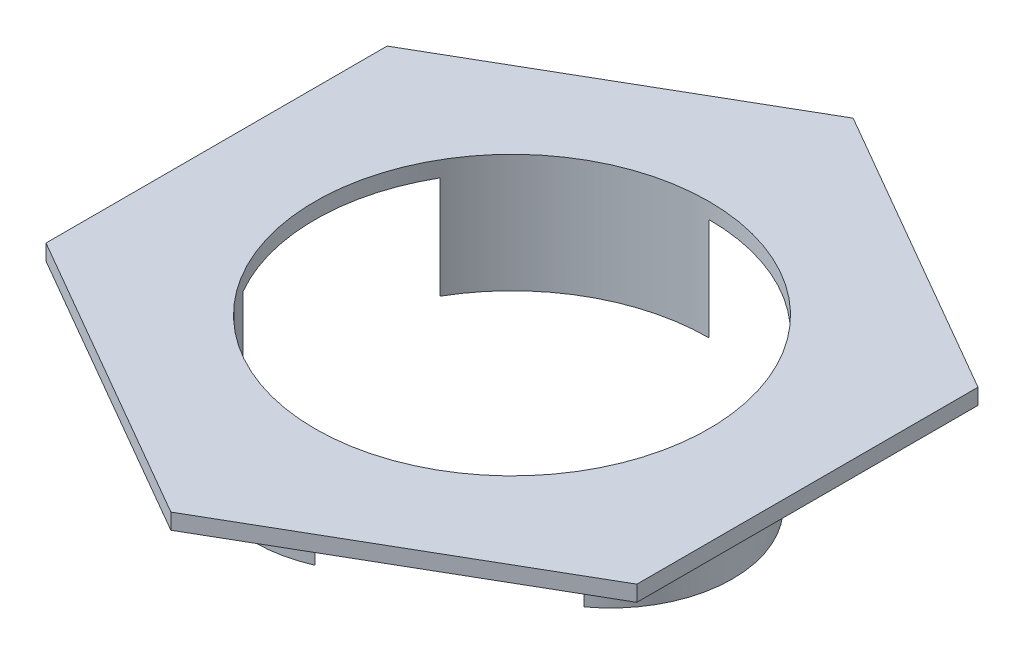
from build123d import *

# Parameters (mm, degrees)
SKETCH1_R           = 317.5
BOSS_EXTRUDE2_DEPTH = 25.4
BOSS_EXTRUDE4_START = 165.1
BOSS_EXTRUDE4_DEPTH = 165.1


with BuildPart() as part:
    # Sketch1 → Boss-Extrude2 (new body)
    with BuildSketch(Plane(origin=(0, 0, 0), x_dir=(1, 0, 0), z_dir=(0, 1, 0))):
        Polygon((0, 549.91), (-476.236029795, 274.955), (-476.236029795, -274.955), (0, -549.91), (476.236029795, -274.955), (476.236029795, 274.955), align=None)
        with Locations(Location((0, 0, 0), (0, 0, 270))):
            Circle(SKETCH1_R, mode=Mode.SUBTRACT)
    extrude(amount=BOSS_EXTRUDE2_DEPTH)

    # Sketch2 → Boss-Extrude4 (add)
    with BuildSketch(Plane.XZ.offset(BOSS_EXTRUDE4_START)):
        with BuildLine():
            ThreePointArc((-158.75, 274.963065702), (-82.17504682, 306.681449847), (0, 317.5))
            ThreePointArc((0, 317.5), (-90.042181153, 334.013459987), (-177.8, 307.958633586))
            Line((-177.8, 307.958633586), (-158.75, 274.963065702))
        make_face()
        with BuildLine():
            Line((-158.75, 274.963065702), (-177.8, 307.958633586))
            ThreePointArc((-177.8, 307.958633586), (-244.243050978, 244.985546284), (-274.963065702, 158.75))
            ThreePointArc((-274.963065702, 158.75), (-224.506403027, 224.506403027), (-158.75, 274.963065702))
        make_face()
        with BuildLine():
            ThreePointArc((-158.75, 274.963065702), (-82.17504682, 306.681449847), (0, 317.5))
            ThreePointArc((0, 317.5), (-90.042181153, 334.013459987), (-177.8, 307.958633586))
            Line((-177.8, 307.958633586), (-158.75, 274.963065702))
        make_face()
        with BuildLine():
            Line((-158.75, 274.963065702), (-177.8, 307.958633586))
            ThreePointArc((-177.8, 307.958633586), (-244.243050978, 244.985546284), (-274.963065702, 158.75))
            ThreePointArc((-274.963065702, 158.75), (-224.506403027, 224.506403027), (-158.75, 274.963065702))
        make_face()
        with BuildLine():
            ThreePointArc((355.6, 0), (334.285232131, 89.027913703), (274.963065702, 158.75))
            ThreePointArc((274.963065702, 158.75), (306.681449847, 82.17504682), (317.5, 0))
            Line((317.5, 0), (355.6, 0))
        make_face()
        with BuildLine():
            ThreePointArc((317.5, 0), (306.681449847, -82.17504682), (274.963065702, -158.75))
            ThreePointArc((274.963065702, -158.75), (334.285232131, -89.027913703), (355.6, 0))
            Line((355.6, 0), (317.5, 0))
        make_face()
        with BuildLine():
            ThreePointArc((355.6, 0), (334.285232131, 89.027913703), (274.963065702, 158.75))
            ThreePointArc((274.963065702, 158.75), (306.681449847, 82.17504682), (317.5, 0))
            Line((317.5, 0), (355.6, 0))
        make_face()
        with BuildLine():
            ThreePointArc((317.5, 0), (306.681449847, -82.17504682), (274.963065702, -158.75))
            ThreePointArc((274.963065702, -158.75), (334.285232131, -89.027913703), (355.6, 0))
            Line((355.6, 0), (317.5, 0))
        make_face()
        with BuildLine():
            ThreePointArc((-177.8, -307.958633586), (-90.042181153, -334.013459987), (0, -317.5))
            ThreePointArc((0, -317.5), (-82.17504682, -306.681449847), (-158.75, -274.963065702))
            Line((-158.75, -274.963065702), (-177.8, -307.958633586))
        make_face()
        with BuildLine():
            ThreePointArc((-158.75, -274.963065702), (-224.506403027, -224.506403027), (-274.963065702, -158.75))
            ThreePointArc((-274.963065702, -158.75), (-244.243050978, -244.985546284), (-177.8, -307.958633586))
            Line((-177.8, -307.958633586), (-158.75, -274.963065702))
        make_face()
        with BuildLine():
            ThreePointArc((-177.8, -307.958633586), (-90.042181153, -334.013459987), (0, -317.5))
            ThreePointArc((0, -317.5), (-82.17504682, -306.681449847), (-158.75, -274.963065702))
            Line((-158.75, -274.963065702), (-177.8, -307.958633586))
        make_face()
        with BuildLine():
            ThreePointArc((-158.75, -274.963065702), (-224.506403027, -224.506403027), (-274.963065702, -158.75))
            ThreePointArc((-274.963065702, -158.75), (-244.243050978, -244.985546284), (-177.8, -307.958633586))
            Line((-177.8, -307.958633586), (-158.75, -274.963065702))
        make_face()
    extrude(amount=-BOSS_EXTRUDE4_DEPTH)


solid = part.part
